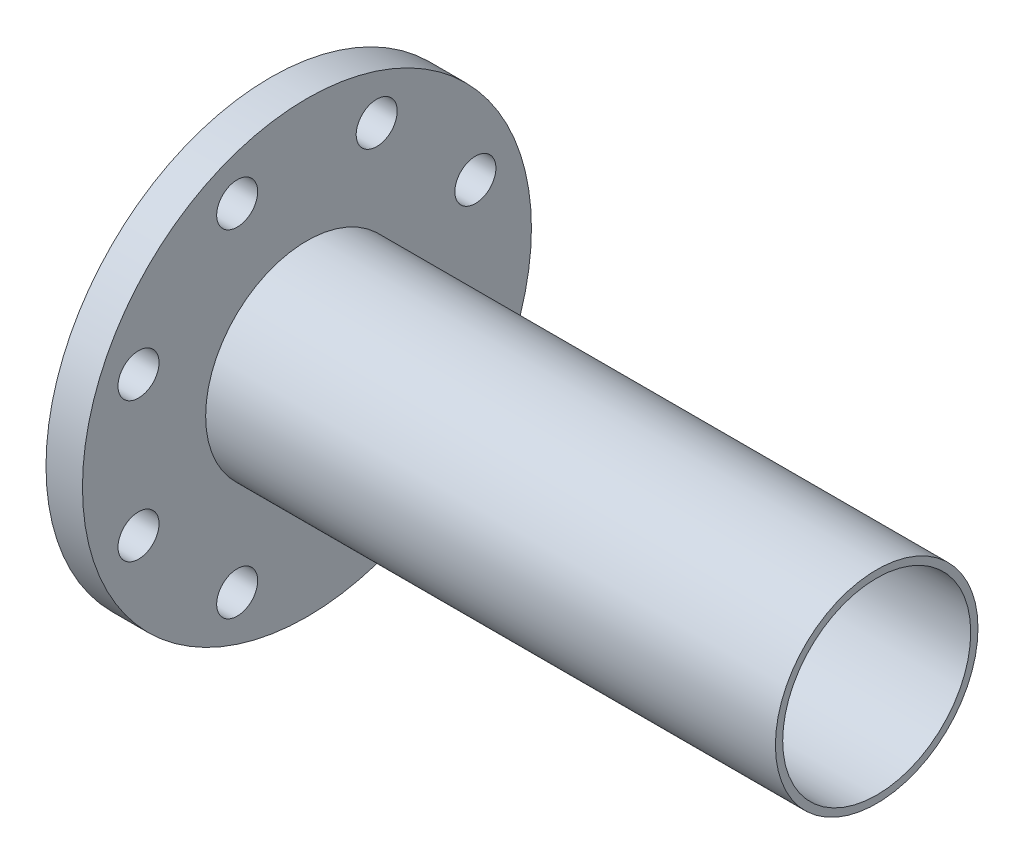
ISO-10303-21;
HEADER;
FILE_DESCRIPTION(('STEP AP214'),'2;1');
FILE_NAME('part.step','',(''),(''),'','','');
FILE_SCHEMA(('AUTOMOTIVE_DESIGN { 1 0 10303 214 1 1 1 1 }'));
ENDSEC;
DATA;
#1=APPLICATION_CONTEXT('core data for automotive mechanical design processes');
#2=APPLICATION_PROTOCOL_DEFINITION('international standard','automotive_design',2000,#1);
#3=PRODUCT_CONTEXT('',#1,'mechanical');
#4=PRODUCT('Part','Part','',(#3));
#5=PRODUCT_RELATED_PRODUCT_CATEGORY('part','',(#4));
#6=PRODUCT_DEFINITION_FORMATION('','',#4);
#7=PRODUCT_DEFINITION_CONTEXT('part definition',#1,'design');
#8=PRODUCT_DEFINITION('design','',#6,#7);
#9=PRODUCT_DEFINITION_SHAPE('','',#8);
#10=(LENGTH_UNIT() NAMED_UNIT(*) SI_UNIT(.MILLI.,.METRE.));
#11=(NAMED_UNIT(*) PLANE_ANGLE_UNIT() SI_UNIT($,.RADIAN.));
#12=(NAMED_UNIT(*) SI_UNIT($,.STERADIAN.) SOLID_ANGLE_UNIT());
#13=UNCERTAINTY_MEASURE_WITH_UNIT(LENGTH_MEASURE(1.E-05),#10,'distance_accuracy_value','');
#14=(GEOMETRIC_REPRESENTATION_CONTEXT(3) GLOBAL_UNCERTAINTY_ASSIGNED_CONTEXT((#13)) GLOBAL_UNIT_ASSIGNED_CONTEXT((#10,
#11,#12)) REPRESENTATION_CONTEXT('',''));
#15=CARTESIAN_POINT('',(0.,0.,0.));
#16=DIRECTION('',(0.,0.,1.));
#17=DIRECTION('',(1.,0.,0.));
#18=AXIS2_PLACEMENT_3D('',#15,#16,#17);
#19=CARTESIAN_POINT('',(250.,-400.,0.));
#20=DIRECTION('',(-1.,0.,0.));
#21=DIRECTION('',(0.,0.,1.));
#22=AXIS2_PLACEMENT_3D('',#19,#20,#21);
#23=CYLINDRICAL_SURFACE('',#22,41.25);
#24=CARTESIAN_POINT('',(250.,-400.,0.));
#25=DIRECTION('',(1.,0.,0.));
#26=DIRECTION('',(0.,0.,-1.));
#27=AXIS2_PLACEMENT_3D('',#24,#25,#26);
#28=CIRCLE('',#27,41.25);
#29=CARTESIAN_POINT('',(250.,-400.,-41.25));
#30=VERTEX_POINT('',#29);
#31=EDGE_CURVE('E80',#30,#30,#28,.T.);
#32=ORIENTED_EDGE('',*,*,#31,.T.);
#33=EDGE_LOOP('',(#32));
#34=FACE_BOUND('',#33,.T.);
#35=CARTESIAN_POINT('',(0.,-400.,0.));
#36=DIRECTION('',(1.,0.,0.));
#37=DIRECTION('',(0.,0.,-1.));
#38=AXIS2_PLACEMENT_3D('',#35,#36,#37);
#39=CIRCLE('',#38,41.25);
#40=CARTESIAN_POINT('',(0.,-400.,-41.25));
#41=VERTEX_POINT('',#40);
#42=EDGE_CURVE('E88',#41,#41,#39,.T.);
#43=ORIENTED_EDGE('',*,*,#42,.F.);
#44=EDGE_LOOP('',(#43));
#45=FACE_BOUND('',#44,.T.);
#46=ADVANCED_FACE('F72',(#34,#45),#23,.F.);
#47=CARTESIAN_POINT('',(250.,-400.,0.));
#48=DIRECTION('',(-1.,0.,0.));
#49=DIRECTION('',(0.,0.,1.));
#50=AXIS2_PLACEMENT_3D('',#47,#48,#49);
#51=CYLINDRICAL_SURFACE('',#50,44.45);
#52=CARTESIAN_POINT('',(250.,-400.,0.));
#53=DIRECTION('',(1.,0.,0.));
#54=DIRECTION('',(0.,0.,-1.));
#55=AXIS2_PLACEMENT_3D('',#52,#53,#54);
#56=CIRCLE('',#55,44.45);
#57=CARTESIAN_POINT('',(250.,-400.,-44.45));
#58=VERTEX_POINT('',#57);
#59=EDGE_CURVE('E14',#58,#58,#56,.T.);
#60=ORIENTED_EDGE('',*,*,#59,.F.);
#61=EDGE_LOOP('',(#60));
#62=FACE_BOUND('',#61,.T.);
#63=CARTESIAN_POINT('',(0.,-400.,0.));
#64=DIRECTION('',(1.,0.,0.));
#65=DIRECTION('',(0.,0.,-1.));
#66=AXIS2_PLACEMENT_3D('',#63,#64,#65);
#67=CIRCLE('',#66,44.45);
#68=CARTESIAN_POINT('',(0.,-400.,-44.45));
#69=VERTEX_POINT('',#68);
#70=EDGE_CURVE('E75',#69,#69,#67,.T.);
#71=ORIENTED_EDGE('',*,*,#70,.T.);
#72=EDGE_LOOP('',(#71));
#73=FACE_BOUND('',#72,.T.);
#74=ADVANCED_FACE('F99',(#62,#73),#51,.T.);
#75=CARTESIAN_POINT('',(250.,-400.,0.));
#76=DIRECTION('',(1.,0.,0.));
#77=DIRECTION('',(0.,0.,-1.));
#78=AXIS2_PLACEMENT_3D('',#75,#76,#77);
#79=PLANE('',#78);
#80=ORIENTED_EDGE('',*,*,#31,.F.);
#81=EDGE_LOOP('',(#80));
#82=FACE_BOUND('',#81,.T.);
#83=ORIENTED_EDGE('',*,*,#59,.T.);
#84=EDGE_LOOP('',(#83));
#85=FACE_BOUND('',#84,.T.);
#86=ADVANCED_FACE('F103',(#82,#85),#79,.T.);
#87=CARTESIAN_POINT('',(0.,-400.,0.));
#88=DIRECTION('',(1.,0.,0.));
#89=DIRECTION('',(0.,0.,-1.));
#90=AXIS2_PLACEMENT_3D('',#87,#88,#89);
#91=PLANE('',#90);
#92=ORIENTED_EDGE('',*,*,#42,.T.);
#93=EDGE_LOOP('',(#92));
#94=FACE_BOUND('',#93,.T.);
#95=ORIENTED_EDGE('',*,*,#70,.F.);
#96=EDGE_LOOP('',(#95));
#97=FACE_BOUND('',#96,.T.);
#98=ADVANCED_FACE('F101',(#94,#97),#91,.F.);
#99=CLOSED_SHELL('',(#46,#74,#86,#98));
#100=MANIFOLD_SOLID_BREP('B2',#99);
#101=CARTESIAN_POINT('',(-16.,-400.,-9.99200722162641E-13));
#102=DIRECTION('',(1.,0.,0.));
#103=DIRECTION('',(0.,0.,-1.));
#104=AXIS2_PLACEMENT_3D('',#101,#102,#103);
#105=CYLINDRICAL_SURFACE('',#104,98.5);
#106=CARTESIAN_POINT('',(-16.,-400.,-9.99200722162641E-13));
#107=DIRECTION('',(1.,0.,0.));
#108=DIRECTION('',(0.,0.,-1.));
#109=AXIS2_PLACEMENT_3D('',#106,#107,#108);
#110=CIRCLE('',#109,98.5);
#111=CARTESIAN_POINT('',(-16.,-400.,-98.500000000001));
#112=VERTEX_POINT('',#111);
#113=EDGE_CURVE('E71',#112,#112,#110,.T.);
#114=ORIENTED_EDGE('',*,*,#113,.T.);
#115=EDGE_LOOP('',(#114));
#116=FACE_BOUND('',#115,.T.);
#117=CARTESIAN_POINT('',(0.,-400.,-9.99200722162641E-13));
#118=DIRECTION('',(1.,0.,0.));
#119=DIRECTION('',(0.,0.,-1.));
#120=AXIS2_PLACEMENT_3D('',#117,#118,#119);
#121=CIRCLE('',#120,98.5);
#122=CARTESIAN_POINT('',(0.,-400.,-98.500000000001));
#123=VERTEX_POINT('',#122);
#124=EDGE_CURVE('E159',#123,#123,#121,.T.);
#125=ORIENTED_EDGE('',*,*,#124,.F.);
#126=EDGE_LOOP('',(#125));
#127=FACE_BOUND('',#126,.T.);
#128=ADVANCED_FACE('F156',(#116,#127),#105,.T.);
#129=CARTESIAN_POINT('',(-16.,-400.,-9.99200722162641E-13));
#130=DIRECTION('',(1.,0.,0.));
#131=DIRECTION('',(0.,0.,-1.));
#132=AXIS2_PLACEMENT_3D('',#129,#130,#131);
#133=PLANE('',#132);
#134=CARTESIAN_POINT('',(-16.,-369.385325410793,73.9103626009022));
#135=DIRECTION('',(1.,0.,0.));
#136=DIRECTION('',(0.,0.,-1.));
#137=AXIS2_PLACEMENT_3D('',#134,#135,#136);
#138=CIRCLE('',#137,9.00000000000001);
#139=CARTESIAN_POINT('',(-16.,-369.385325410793,64.9103626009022));
#140=VERTEX_POINT('',#139);
#141=EDGE_CURVE('E231',#140,#140,#138,.T.);
#142=ORIENTED_EDGE('',*,*,#141,.T.);
#143=EDGE_LOOP('',(#142));
#144=FACE_BOUND('',#143,.T.);
#145=CARTESIAN_POINT('',(-16.,-430.614674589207,73.9103626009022));
#146=DIRECTION('',(1.,0.,0.));
#147=DIRECTION('',(0.,0.,-1.));
#148=AXIS2_PLACEMENT_3D('',#145,#146,#147);
#149=CIRCLE('',#148,9.00000000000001);
#150=CARTESIAN_POINT('',(-16.,-430.614674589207,64.9103626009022));
#151=VERTEX_POINT('',#150);
#152=EDGE_CURVE('E223',#151,#151,#149,.T.);
#153=ORIENTED_EDGE('',*,*,#152,.T.);
#154=EDGE_LOOP('',(#153));
#155=FACE_BOUND('',#154,.T.);
#156=CARTESIAN_POINT('',(-16.,-473.910362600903,30.6146745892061));
#157=DIRECTION('',(1.,0.,0.));
#158=DIRECTION('',(0.,0.,-1.));
#159=AXIS2_PLACEMENT_3D('',#156,#157,#158);
#160=CIRCLE('',#159,9.00000000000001);
#161=CARTESIAN_POINT('',(-16.,-473.910362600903,21.6146745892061));
#162=VERTEX_POINT('',#161);
#163=EDGE_CURVE('E215',#162,#162,#160,.T.);
#164=ORIENTED_EDGE('',*,*,#163,.T.);
#165=EDGE_LOOP('',(#164));
#166=FACE_BOUND('',#165,.T.);
#167=CARTESIAN_POINT('',(-16.,-473.910362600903,-30.6146745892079));
#168=DIRECTION('',(1.,0.,0.));
#169=DIRECTION('',(0.,0.,-1.));
#170=AXIS2_PLACEMENT_3D('',#167,#168,#169);
#171=CIRCLE('',#170,9.);
#172=CARTESIAN_POINT('',(-16.,-473.910362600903,-39.6146745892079));
#173=VERTEX_POINT('',#172);
#174=EDGE_CURVE('E207',#173,#173,#171,.T.);
#175=ORIENTED_EDGE('',*,*,#174,.T.);
#176=EDGE_LOOP('',(#175));
#177=FACE_BOUND('',#176,.T.);
#178=CARTESIAN_POINT('',(-16.,-430.614674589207,-73.9103626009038));
#179=DIRECTION('',(1.,0.,0.));
#180=DIRECTION('',(0.,0.,-1.));
#181=AXIS2_PLACEMENT_3D('',#178,#179,#180);
#182=CIRCLE('',#181,9.);
#183=CARTESIAN_POINT('',(-16.,-430.614674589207,-82.9103626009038));
#184=VERTEX_POINT('',#183);
#185=EDGE_CURVE('E199',#184,#184,#182,.T.);
#186=ORIENTED_EDGE('',*,*,#185,.T.);
#187=EDGE_LOOP('',(#186));
#188=FACE_BOUND('',#187,.T.);
#189=CARTESIAN_POINT('',(-16.,-369.385325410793,-73.9103626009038));
#190=DIRECTION('',(1.,0.,0.));
#191=DIRECTION('',(0.,0.,-1.));
#192=AXIS2_PLACEMENT_3D('',#189,#190,#191);
#193=CIRCLE('',#192,9.);
#194=CARTESIAN_POINT('',(-16.,-369.385325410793,-82.9103626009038));
#195=VERTEX_POINT('',#194);
#196=EDGE_CURVE('E191',#195,#195,#193,.T.);
#197=ORIENTED_EDGE('',*,*,#196,.T.);
#198=EDGE_LOOP('',(#197));
#199=FACE_BOUND('',#198,.T.);
#200=CARTESIAN_POINT('',(-16.,-326.089637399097,-30.6146745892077));
#201=DIRECTION('',(1.,0.,0.));
#202=DIRECTION('',(0.,0.,-1.));
#203=AXIS2_PLACEMENT_3D('',#200,#201,#202);
#204=CIRCLE('',#203,9.);
#205=CARTESIAN_POINT('',(-16.,-326.089637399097,-39.6146745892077));
#206=VERTEX_POINT('',#205);
#207=EDGE_CURVE('E183',#206,#206,#204,.T.);
#208=ORIENTED_EDGE('',*,*,#207,.T.);
#209=EDGE_LOOP('',(#208));
#210=FACE_BOUND('',#209,.T.);
#211=CARTESIAN_POINT('',(-16.,-326.089637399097,30.6146745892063));
#212=DIRECTION('',(1.,0.,0.));
#213=DIRECTION('',(0.,0.,-1.));
#214=AXIS2_PLACEMENT_3D('',#211,#212,#213);
#215=CIRCLE('',#214,9.00000000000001);
#216=CARTESIAN_POINT('',(-16.,-326.089637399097,21.6146745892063));
#217=VERTEX_POINT('',#216);
#218=EDGE_CURVE('E175',#217,#217,#215,.T.);
#219=ORIENTED_EDGE('',*,*,#218,.T.);
#220=EDGE_LOOP('',(#219));
#221=FACE_BOUND('',#220,.T.);
#222=CARTESIAN_POINT('',(-16.,-400.,-9.99200722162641E-13));
#223=DIRECTION('',(1.,0.,0.));
#224=DIRECTION('',(0.,0.,-1.));
#225=AXIS2_PLACEMENT_3D('',#222,#223,#224);
#226=CIRCLE('',#225,40.);
#227=CARTESIAN_POINT('',(-16.,-400.,-40.000000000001));
#228=VERTEX_POINT('',#227);
#229=EDGE_CURVE('E169',#228,#228,#226,.T.);
#230=ORIENTED_EDGE('',*,*,#229,.T.);
#231=EDGE_LOOP('',(#230));
#232=FACE_BOUND('',#231,.T.);
#233=ORIENTED_EDGE('',*,*,#113,.F.);
#234=EDGE_LOOP('',(#233));
#235=FACE_BOUND('',#234,.T.);
#236=ADVANCED_FACE('F244',(#144,#155,#166,#177,#188,#199,#210,#221,#232,#235),#133,.F.);
#237=CARTESIAN_POINT('',(0.,-400.,-9.99200722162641E-13));
#238=DIRECTION('',(1.,0.,0.));
#239=DIRECTION('',(0.,0.,-1.));
#240=AXIS2_PLACEMENT_3D('',#237,#238,#239);
#241=PLANE('',#240);
#242=CARTESIAN_POINT('',(0.,-369.385325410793,73.9103626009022));
#243=DIRECTION('',(1.,0.,0.));
#244=DIRECTION('',(0.,0.,-1.));
#245=AXIS2_PLACEMENT_3D('',#242,#243,#244);
#246=CIRCLE('',#245,9.00000000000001);
#247=CARTESIAN_POINT('',(0.,-369.385325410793,64.9103626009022));
#248=VERTEX_POINT('',#247);
#249=EDGE_CURVE('E235',#248,#248,#246,.T.);
#250=ORIENTED_EDGE('',*,*,#249,.F.);
#251=EDGE_LOOP('',(#250));
#252=FACE_BOUND('',#251,.T.);
#253=CARTESIAN_POINT('',(0.,-430.614674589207,73.9103626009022));
#254=DIRECTION('',(1.,0.,0.));
#255=DIRECTION('',(0.,0.,-1.));
#256=AXIS2_PLACEMENT_3D('',#253,#254,#255);
#257=CIRCLE('',#256,9.00000000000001);
#258=CARTESIAN_POINT('',(0.,-430.614674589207,64.9103626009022));
#259=VERTEX_POINT('',#258);
#260=EDGE_CURVE('E227',#259,#259,#257,.T.);
#261=ORIENTED_EDGE('',*,*,#260,.F.);
#262=EDGE_LOOP('',(#261));
#263=FACE_BOUND('',#262,.T.);
#264=CARTESIAN_POINT('',(0.,-473.910362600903,30.6146745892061));
#265=DIRECTION('',(1.,0.,0.));
#266=DIRECTION('',(0.,0.,-1.));
#267=AXIS2_PLACEMENT_3D('',#264,#265,#266);
#268=CIRCLE('',#267,9.00000000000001);
#269=CARTESIAN_POINT('',(0.,-473.910362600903,21.6146745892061));
#270=VERTEX_POINT('',#269);
#271=EDGE_CURVE('E219',#270,#270,#268,.T.);
#272=ORIENTED_EDGE('',*,*,#271,.F.);
#273=EDGE_LOOP('',(#272));
#274=FACE_BOUND('',#273,.T.);
#275=CARTESIAN_POINT('',(0.,-473.910362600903,-30.6146745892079));
#276=DIRECTION('',(1.,0.,0.));
#277=DIRECTION('',(0.,0.,-1.));
#278=AXIS2_PLACEMENT_3D('',#275,#276,#277);
#279=CIRCLE('',#278,9.);
#280=CARTESIAN_POINT('',(0.,-473.910362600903,-39.6146745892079));
#281=VERTEX_POINT('',#280);
#282=EDGE_CURVE('E211',#281,#281,#279,.T.);
#283=ORIENTED_EDGE('',*,*,#282,.F.);
#284=EDGE_LOOP('',(#283));
#285=FACE_BOUND('',#284,.T.);
#286=CARTESIAN_POINT('',(0.,-430.614674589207,-73.9103626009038));
#287=DIRECTION('',(1.,0.,0.));
#288=DIRECTION('',(0.,0.,-1.));
#289=AXIS2_PLACEMENT_3D('',#286,#287,#288);
#290=CIRCLE('',#289,9.);
#291=CARTESIAN_POINT('',(0.,-430.614674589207,-82.9103626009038));
#292=VERTEX_POINT('',#291);
#293=EDGE_CURVE('E203',#292,#292,#290,.T.);
#294=ORIENTED_EDGE('',*,*,#293,.F.);
#295=EDGE_LOOP('',(#294));
#296=FACE_BOUND('',#295,.T.);
#297=CARTESIAN_POINT('',(0.,-369.385325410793,-73.9103626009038));
#298=DIRECTION('',(1.,0.,0.));
#299=DIRECTION('',(0.,0.,-1.));
#300=AXIS2_PLACEMENT_3D('',#297,#298,#299);
#301=CIRCLE('',#300,9.);
#302=CARTESIAN_POINT('',(0.,-369.385325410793,-82.9103626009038));
#303=VERTEX_POINT('',#302);
#304=EDGE_CURVE('E195',#303,#303,#301,.T.);
#305=ORIENTED_EDGE('',*,*,#304,.F.);
#306=EDGE_LOOP('',(#305));
#307=FACE_BOUND('',#306,.T.);
#308=CARTESIAN_POINT('',(0.,-326.089637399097,-30.6146745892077));
#309=DIRECTION('',(1.,0.,0.));
#310=DIRECTION('',(0.,0.,-1.));
#311=AXIS2_PLACEMENT_3D('',#308,#309,#310);
#312=CIRCLE('',#311,9.);
#313=CARTESIAN_POINT('',(0.,-326.089637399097,-39.6146745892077));
#314=VERTEX_POINT('',#313);
#315=EDGE_CURVE('E187',#314,#314,#312,.T.);
#316=ORIENTED_EDGE('',*,*,#315,.F.);
#317=EDGE_LOOP('',(#316));
#318=FACE_BOUND('',#317,.T.);
#319=CARTESIAN_POINT('',(0.,-326.089637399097,30.6146745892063));
#320=DIRECTION('',(1.,0.,0.));
#321=DIRECTION('',(0.,0.,-1.));
#322=AXIS2_PLACEMENT_3D('',#319,#320,#321);
#323=CIRCLE('',#322,9.00000000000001);
#324=CARTESIAN_POINT('',(0.,-326.089637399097,21.6146745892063));
#325=VERTEX_POINT('',#324);
#326=EDGE_CURVE('E179',#325,#325,#323,.T.);
#327=ORIENTED_EDGE('',*,*,#326,.F.);
#328=EDGE_LOOP('',(#327));
#329=FACE_BOUND('',#328,.T.);
#330=CARTESIAN_POINT('',(0.,-400.,-9.99200722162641E-13));
#331=DIRECTION('',(1.,0.,0.));
#332=DIRECTION('',(0.,0.,-1.));
#333=AXIS2_PLACEMENT_3D('',#330,#331,#332);
#334=CIRCLE('',#333,40.);
#335=CARTESIAN_POINT('',(0.,-400.,-40.000000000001));
#336=VERTEX_POINT('',#335);
#337=EDGE_CURVE('E171',#336,#336,#334,.T.);
#338=ORIENTED_EDGE('',*,*,#337,.F.);
#339=EDGE_LOOP('',(#338));
#340=FACE_BOUND('',#339,.T.);
#341=ORIENTED_EDGE('',*,*,#124,.T.);
#342=EDGE_LOOP('',(#341));
#343=FACE_BOUND('',#342,.T.);
#344=ADVANCED_FACE('F254',(#252,#263,#274,#285,#296,#307,#318,#329,#340,#343),#241,.T.);
#345=CARTESIAN_POINT('',(-16.,-400.,-9.99200722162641E-13));
#346=DIRECTION('',(1.,0.,0.));
#347=DIRECTION('',(0.,0.,-1.));
#348=AXIS2_PLACEMENT_3D('',#345,#346,#347);
#349=CYLINDRICAL_SURFACE('',#348,40.);
#350=ORIENTED_EDGE('',*,*,#229,.F.);
#351=EDGE_LOOP('',(#350));
#352=FACE_BOUND('',#351,.T.);
#353=ORIENTED_EDGE('',*,*,#337,.T.);
#354=EDGE_LOOP('',(#353));
#355=FACE_BOUND('',#354,.T.);
#356=ADVANCED_FACE('F257',(#352,#355),#349,.F.);
#357=CARTESIAN_POINT('',(-16.,-326.089637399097,30.6146745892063));
#358=DIRECTION('',(1.,0.,0.));
#359=DIRECTION('',(0.,0.,-1.));
#360=AXIS2_PLACEMENT_3D('',#357,#358,#359);
#361=CYLINDRICAL_SURFACE('',#360,9.00000000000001);
#362=ORIENTED_EDGE('',*,*,#218,.F.);
#363=EDGE_LOOP('',(#362));
#364=FACE_BOUND('',#363,.T.);
#365=ORIENTED_EDGE('',*,*,#326,.T.);
#366=EDGE_LOOP('',(#365));
#367=FACE_BOUND('',#366,.T.);
#368=ADVANCED_FACE('F286',(#364,#367),#361,.F.);
#369=CARTESIAN_POINT('',(-16.,-326.089637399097,-30.6146745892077));
#370=DIRECTION('',(1.,0.,0.));
#371=DIRECTION('',(0.,0.,-1.));
#372=AXIS2_PLACEMENT_3D('',#369,#370,#371);
#373=CYLINDRICAL_SURFACE('',#372,9.);
#374=ORIENTED_EDGE('',*,*,#207,.F.);
#375=EDGE_LOOP('',(#374));
#376=FACE_BOUND('',#375,.T.);
#377=ORIENTED_EDGE('',*,*,#315,.T.);
#378=EDGE_LOOP('',(#377));
#379=FACE_BOUND('',#378,.T.);
#380=ADVANCED_FACE('F290',(#376,#379),#373,.F.);
#381=CARTESIAN_POINT('',(-16.,-369.385325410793,-73.9103626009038));
#382=DIRECTION('',(1.,0.,0.));
#383=DIRECTION('',(0.,0.,-1.));
#384=AXIS2_PLACEMENT_3D('',#381,#382,#383);
#385=CYLINDRICAL_SURFACE('',#384,9.);
#386=ORIENTED_EDGE('',*,*,#196,.F.);
#387=EDGE_LOOP('',(#386));
#388=FACE_BOUND('',#387,.T.);
#389=ORIENTED_EDGE('',*,*,#304,.T.);
#390=EDGE_LOOP('',(#389));
#391=FACE_BOUND('',#390,.T.);
#392=ADVANCED_FACE('F294',(#388,#391),#385,.F.);
#393=CARTESIAN_POINT('',(-16.,-430.614674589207,-73.9103626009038));
#394=DIRECTION('',(1.,0.,0.));
#395=DIRECTION('',(0.,0.,-1.));
#396=AXIS2_PLACEMENT_3D('',#393,#394,#395);
#397=CYLINDRICAL_SURFACE('',#396,9.);
#398=ORIENTED_EDGE('',*,*,#185,.F.);
#399=EDGE_LOOP('',(#398));
#400=FACE_BOUND('',#399,.T.);
#401=ORIENTED_EDGE('',*,*,#293,.T.);
#402=EDGE_LOOP('',(#401));
#403=FACE_BOUND('',#402,.T.);
#404=ADVANCED_FACE('F298',(#400,#403),#397,.F.);
#405=CARTESIAN_POINT('',(-16.,-473.910362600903,-30.6146745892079));
#406=DIRECTION('',(1.,0.,0.));
#407=DIRECTION('',(0.,0.,-1.));
#408=AXIS2_PLACEMENT_3D('',#405,#406,#407);
#409=CYLINDRICAL_SURFACE('',#408,9.);
#410=ORIENTED_EDGE('',*,*,#174,.F.);
#411=EDGE_LOOP('',(#410));
#412=FACE_BOUND('',#411,.T.);
#413=ORIENTED_EDGE('',*,*,#282,.T.);
#414=EDGE_LOOP('',(#413));
#415=FACE_BOUND('',#414,.T.);
#416=ADVANCED_FACE('F302',(#412,#415),#409,.F.);
#417=CARTESIAN_POINT('',(-16.,-473.910362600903,30.6146745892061));
#418=DIRECTION('',(1.,0.,0.));
#419=DIRECTION('',(0.,0.,-1.));
#420=AXIS2_PLACEMENT_3D('',#417,#418,#419);
#421=CYLINDRICAL_SURFACE('',#420,9.00000000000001);
#422=ORIENTED_EDGE('',*,*,#163,.F.);
#423=EDGE_LOOP('',(#422));
#424=FACE_BOUND('',#423,.T.);
#425=ORIENTED_EDGE('',*,*,#271,.T.);
#426=EDGE_LOOP('',(#425));
#427=FACE_BOUND('',#426,.T.);
#428=ADVANCED_FACE('F306',(#424,#427),#421,.F.);
#429=CARTESIAN_POINT('',(-16.,-430.614674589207,73.9103626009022));
#430=DIRECTION('',(1.,0.,0.));
#431=DIRECTION('',(0.,0.,-1.));
#432=AXIS2_PLACEMENT_3D('',#429,#430,#431);
#433=CYLINDRICAL_SURFACE('',#432,9.00000000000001);
#434=ORIENTED_EDGE('',*,*,#152,.F.);
#435=EDGE_LOOP('',(#434));
#436=FACE_BOUND('',#435,.T.);
#437=ORIENTED_EDGE('',*,*,#260,.T.);
#438=EDGE_LOOP('',(#437));
#439=FACE_BOUND('',#438,.T.);
#440=ADVANCED_FACE('F250',(#436,#439),#433,.F.);
#441=CARTESIAN_POINT('',(-16.,-369.385325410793,73.9103626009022));
#442=DIRECTION('',(1.,0.,0.));
#443=DIRECTION('',(0.,0.,-1.));
#444=AXIS2_PLACEMENT_3D('',#441,#442,#443);
#445=CYLINDRICAL_SURFACE('',#444,9.00000000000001);
#446=ORIENTED_EDGE('',*,*,#141,.F.);
#447=EDGE_LOOP('',(#446));
#448=FACE_BOUND('',#447,.T.);
#449=ORIENTED_EDGE('',*,*,#249,.T.);
#450=EDGE_LOOP('',(#449));
#451=FACE_BOUND('',#450,.T.);
#452=ADVANCED_FACE('F247',(#448,#451),#445,.F.);
#453=CLOSED_SHELL('',(#128,#236,#344,#356,#368,#380,#392,#404,#416,#428,#440,#452));
#454=MANIFOLD_SOLID_BREP('B9',#453);
#455=ADVANCED_BREP_SHAPE_REPRESENTATION('',(#18,#100,#454),#14);
#456=SHAPE_DEFINITION_REPRESENTATION(#9,#455);
ENDSEC;
END-ISO-10303-21;
